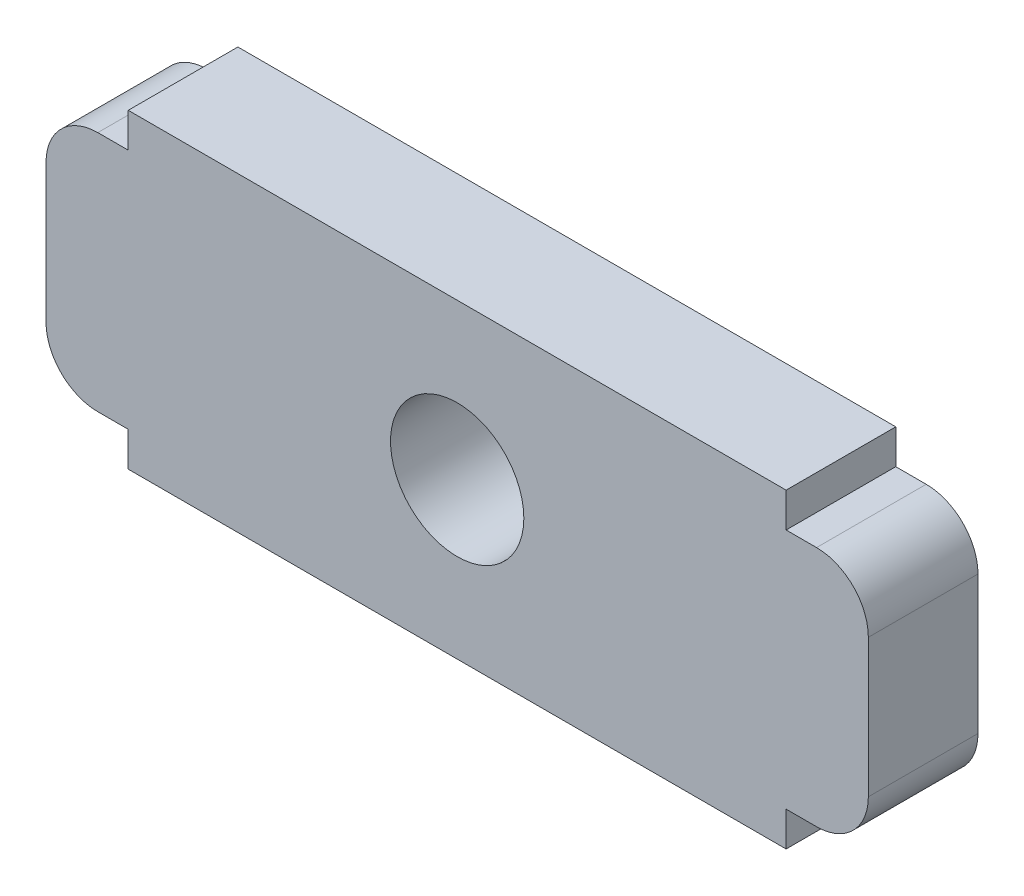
from build123d import *

# Parameters (mm, degrees)
SKETCH1_R           = 1.9304
BOSS_EXTRUDE1_DEPTH = 3.175
FILLET1_R           = 1.5


with BuildPart() as part:
    # Sketch1 → Boss-Extrude1 (new body)
    with BuildSketch(Plane.XY):
        Polygon((-9.525, 4.5), (-9.525, 3.5), (-11.90625, 3.5), (-11.90625, -3.5), (-9.525, -3.5), (-9.525, -4.5), (9.525, -4.5), (9.525, -3.5), (11.90625, -3.5), (11.90625, 3.5), (9.525, 3.5), (9.525, 4.5), align=None)
        Circle(SKETCH1_R, mode=Mode.SUBTRACT)
    extrude(amount=BOSS_EXTRUDE1_DEPTH)

    # Fillet1
    fillet1_edges = [part.edges().sort_by_distance(p)[0] for p in [
        (11.90625, 3.5, 1.5875),
        (11.90625, -3.5, 1.5875),
        (-11.90625, -3.5, 1.5875),
        (-11.90625, 3.5, 1.5875),
    ]]
    fillet(fillet1_edges, radius=FILLET1_R)


solid = part.part
